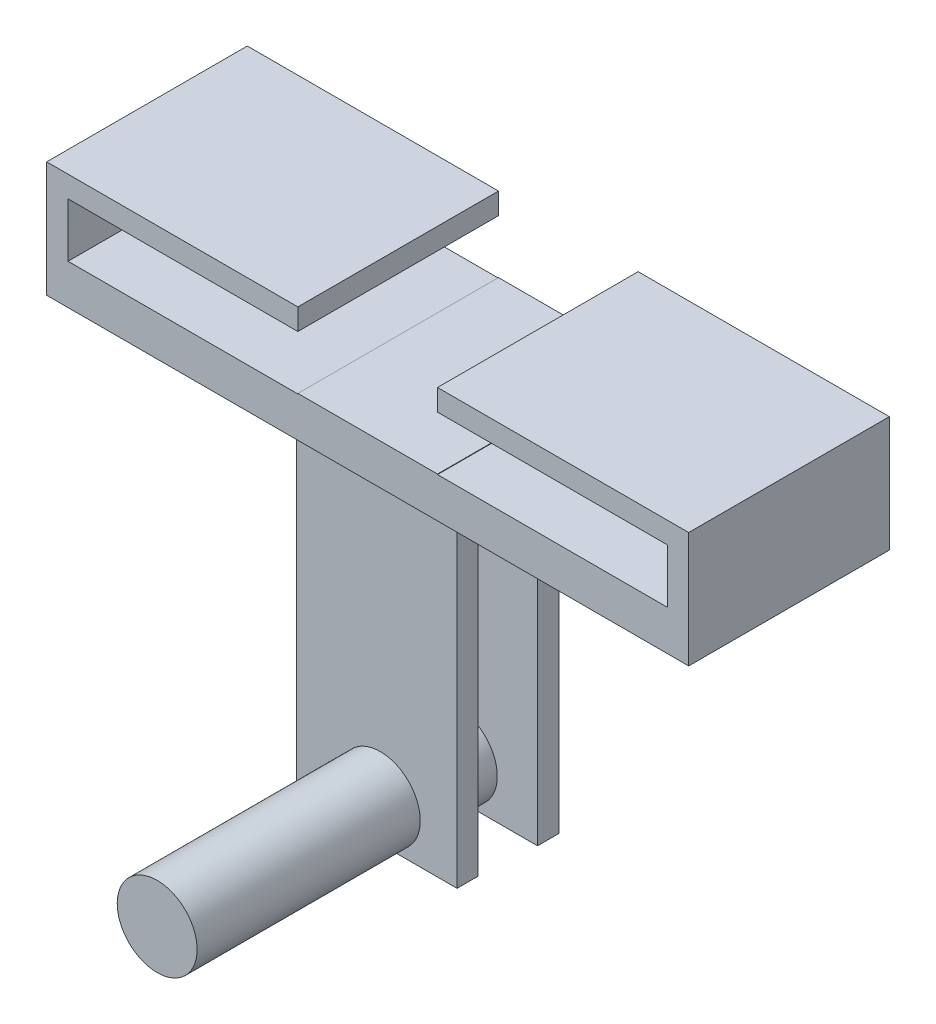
from build123d import *

# Parameters (mm, degrees)
SKETCH1_W           = 101.6
SKETCH1_H           = 31.75
BOSS_EXTRUDE1_DEPTH = 18.288
SKETCH2_W           = 22.098
SKETCH2_H           = 31.75
CUT_EXTRUDE1_DEPTH  = 11.8618
SKETCH3_W           = 36.3728
SKETCH3_H           = 8.5598
CUT_EXTRUDE2_DEPTH  = 109.004969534
SKETCH4_W           = 25.37968
SKETCH4_H           = 3.3782
BOSS_EXTRUDE2_DEPTH = 50.8
BOSS_EXTRUDE3_DEPTH = 47.498
BOSS_EXTRUDE4_DEPTH = 47.498
SKETCH10_W          = 25.4
SKETCH10_H          = 3.302
BOSS_EXTRUDE5_DEPTH = 50.8


with BuildPart() as part:
    # Sketch1 → Boss-Extrude1 (new body)
    with BuildSketch(Plane(origin=(0, 0, 0), x_dir=(1, 0, 0), z_dir=(0, 1, 0))):
        with Locations((50.8, 15.875)):
            Rectangle(SKETCH1_W, SKETCH1_H)
    extrude(amount=BOSS_EXTRUDE1_DEPTH)

    # Sketch2 → Cut-Extrude1 (cut)
    with BuildSketch(Plane(origin=(0, 18.288, 0), x_dir=(1, 0, 0), z_dir=(0, 1, 0))):
        with Locations((50.8, 15.875)):
            Rectangle(SKETCH2_W, SKETCH2_H)
    extrude(amount=-CUT_EXTRUDE1_DEPTH, mode=Mode.SUBTRACT)

    # Sketch3 → Cut-Extrude2 (cut, through all)
    with BuildSketch(Plane.XY):
        with Locations((80.0354, 10.6299)):
            Rectangle(SKETCH3_W, SKETCH3_H)
        with Locations((21.5646, 10.6299)):
            Rectangle(SKETCH3_W, SKETCH3_H)
    extrude(amount=-CUT_EXTRUDE2_DEPTH, mode=Mode.SUBTRACT)

    # Sketch4 → Boss-Extrude2 (add)
    with BuildSketch(Plane.XZ):
        with Locations((50.8, -15.875)):
            Rectangle(SKETCH4_W, SKETCH4_H)
    extrude(amount=BOSS_EXTRUDE2_DEPTH)

    # Sketch5 → Boss-Extrude3 (add)
    with BuildSketch(Plane.XY.offset(-14.1859)):
        with BuildLine():
            Line((44.4754, -44.45), (57.1246, -44.45))
            ThreePointArc((57.1246, -44.45), (50.8, -38.1254), (44.4754, -44.45))
        make_face()
    extrude(amount=BOSS_EXTRUDE3_DEPTH)

    # Sketch8 → Boss-Extrude4 (add)
    with BuildSketch(Plane.XY.offset(-14.1859)):
        with BuildLine():
            Line((44.4754, -44.45), (57.1246, -44.45))
            ThreePointArc((57.1246, -44.45), (50.8, -50.7746), (44.4754, -44.45))
        make_face()
    extrude(amount=BOSS_EXTRUDE4_DEPTH)

    # Sketch10 → Boss-Extrude5 (add)
    with BuildSketch(Plane.XZ):
        with Locations((50.252154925, -3.6449)):
            Rectangle(SKETCH10_W, SKETCH10_H)
    extrude(amount=BOSS_EXTRUDE5_DEPTH)


solid = part.part
